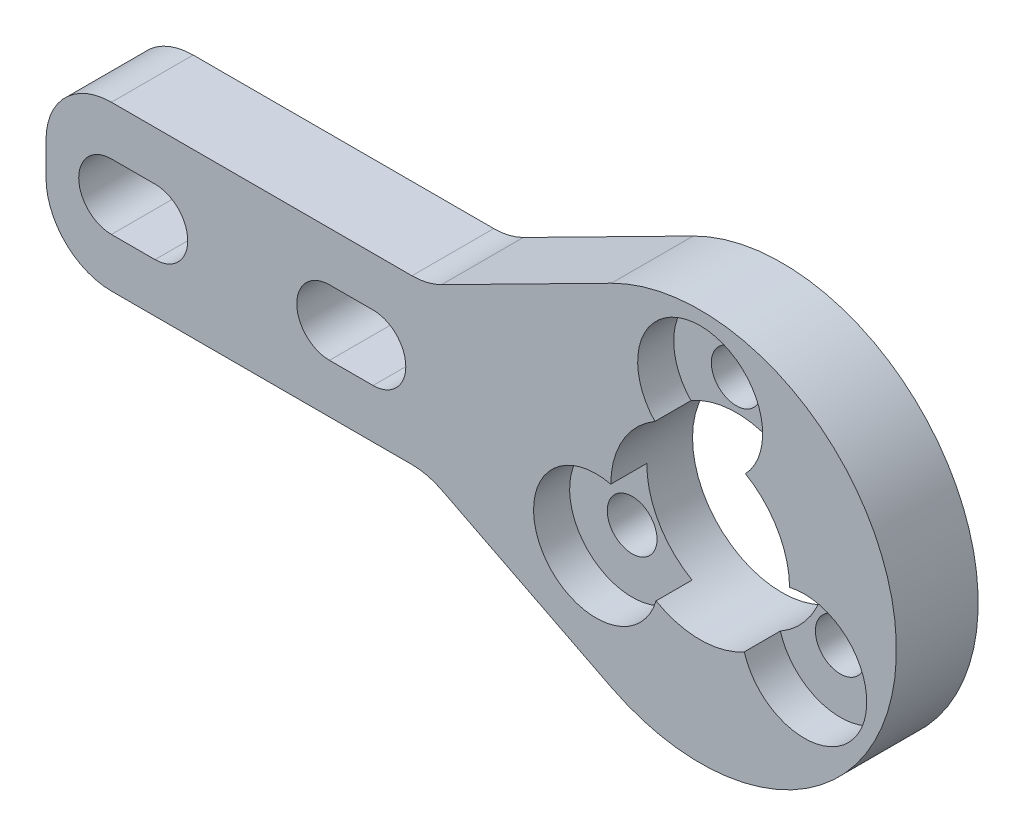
from build123d import *

# Parameters (mm, degrees)
SKETCH1_R                                          = 5.207
EXTRUDE1_DEPTH                                     = 4.7625
CBORE_FOR_M2_5_HEX_HEAD_MACHINE_SCREW1_D           = 2.9
CBORE_FOR_M2_5_HEX_HEAD_MACHINE_SCREW1_CBORE_D     = 7.28
CBORE_FOR_M2_5_HEX_HEAD_MACHINE_SCREW1_CBORE_DEPTH = 2.1
CUT_EXTRUDE1_DEPTH                                 = 41.061656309
FILLET3_R                                          = 3.81


with BuildPart() as part:
    # Sketch1 → Extrude1 (new body)
    with BuildSketch(Plane.XY):
        with BuildLine():
            Line((-5.171679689, 10.193067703), (-15.875, 4.7625))
            Line((-15.875, 4.7625), (-38.1, 4.7625))
            Line((-38.1, 4.7625), (-38.1, -4.7625))
            Line((-38.1, -4.7625), (-15.875, -4.7625))
            Line((-15.875, -4.7625), (-5.171679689, -10.193067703))
            ThreePointArc((-5.171679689, -10.193067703), (11.43, 0), (-5.171679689, 10.193067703))
        make_face()
        with Locations(Location((0, 0, 0), (0, 0, 180))):
            Circle(SKETCH1_R, mode=Mode.SUBTRACT)
    extrude(amount=EXTRUDE1_DEPTH)

    # CBORE for M2.5 Hex Head Machine Screw1 (through all)
    with Locations(Plane.XY.offset(4.7625)):
        with Locations((0, 7), (6.062177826, -3.5), (-6.062177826, -3.5)):
            CounterBoreHole(CBORE_FOR_M2_5_HEX_HEAD_MACHINE_SCREW1_D / 2, CBORE_FOR_M2_5_HEX_HEAD_MACHINE_SCREW1_CBORE_D / 2, CBORE_FOR_M2_5_HEX_HEAD_MACHINE_SCREW1_CBORE_DEPTH)

    # Sketch4 → Cut-Extrude1 (cut, through all)
    with BuildSketch(Plane.XY.offset(4.7625)):
        with BuildLine():
            Line((-34.29, 1.905), (-31.75, 1.905))
            ThreePointArc((-31.75, 1.905), (-29.845, 0), (-31.75, -1.905))
            Line((-31.75, -1.905), (-34.29, -1.905))
            ThreePointArc((-34.29, -1.905), (-36.195, 0), (-34.29, 1.905))
        make_face()
        with BuildLine():
            Line((-21.59, -1.905), (-19.05, -1.905))
            ThreePointArc((-19.05, -1.905), (-17.145, 0), (-19.05, 1.905))
            Line((-19.05, 1.905), (-21.59, 1.905))
            ThreePointArc((-21.59, 1.905), (-23.495, 0), (-21.59, -1.905))
        make_face()
    extrude(amount=-CUT_EXTRUDE1_DEPTH, mode=Mode.SUBTRACT)

    # Fillet3
    fillet3_edges = [part.edges().sort_by_distance(p)[0] for p in [
        (-38.1, -4.7625, 2.38125),
        (-38.1, 4.7625, 2.38125),
        (-15.875, 4.7625, 2.38125),
        (-15.875, -4.7625, 2.38125),
    ]]
    fillet(fillet3_edges, radius=FILLET3_R)


solid = part.part
